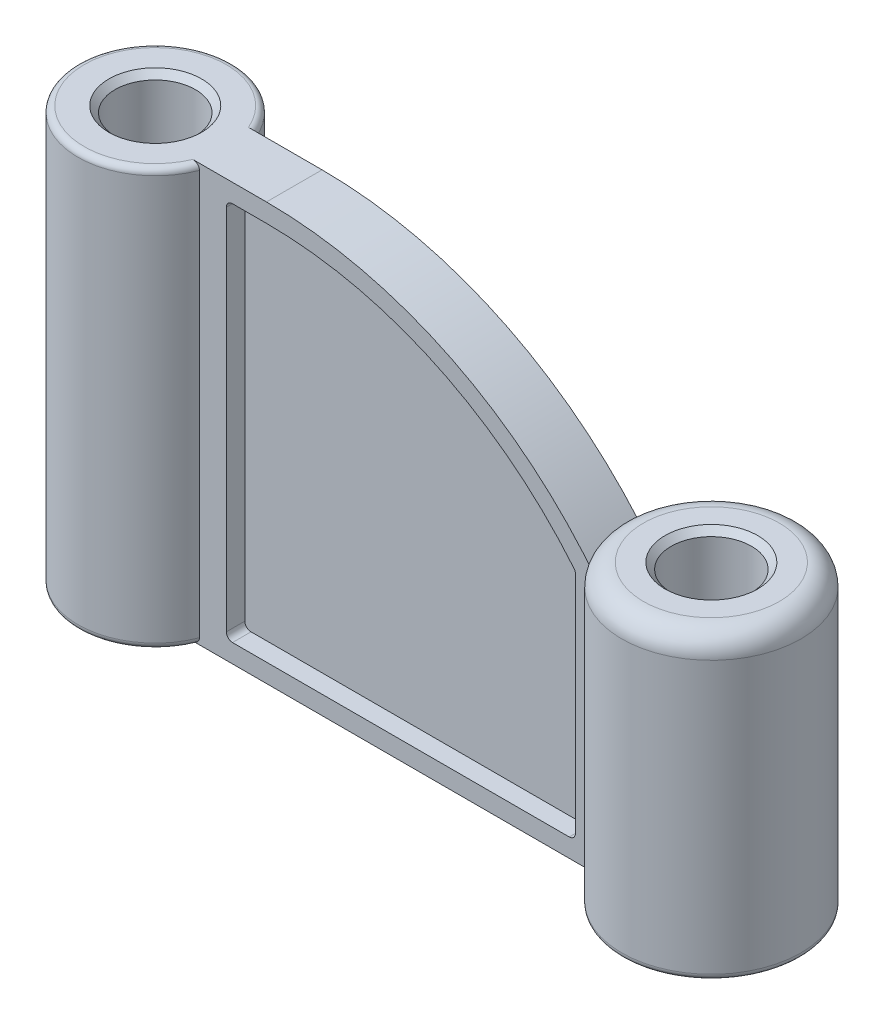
ISO-10303-21;
HEADER;
FILE_DESCRIPTION(('STEP AP214'),'2;1');
FILE_NAME('part.step','',(''),(''),'','','');
FILE_SCHEMA(('AUTOMOTIVE_DESIGN { 1 0 10303 214 1 1 1 1 }'));
ENDSEC;
DATA;
#1=APPLICATION_CONTEXT('core data for automotive mechanical design processes');
#2=APPLICATION_PROTOCOL_DEFINITION('international standard','automotive_design',2000,#1);
#3=PRODUCT_CONTEXT('',#1,'mechanical');
#4=PRODUCT('Part','Part','',(#3));
#5=PRODUCT_RELATED_PRODUCT_CATEGORY('part','',(#4));
#6=PRODUCT_DEFINITION_FORMATION('','',#4);
#7=PRODUCT_DEFINITION_CONTEXT('part definition',#1,'design');
#8=PRODUCT_DEFINITION('design','',#6,#7);
#9=PRODUCT_DEFINITION_SHAPE('','',#8);
#10=(LENGTH_UNIT() NAMED_UNIT(*) SI_UNIT(.MILLI.,.METRE.));
#11=(NAMED_UNIT(*) PLANE_ANGLE_UNIT() SI_UNIT($,.RADIAN.));
#12=(NAMED_UNIT(*) SI_UNIT($,.STERADIAN.) SOLID_ANGLE_UNIT());
#13=UNCERTAINTY_MEASURE_WITH_UNIT(LENGTH_MEASURE(1.E-05),#10,'distance_accuracy_value','');
#14=(GEOMETRIC_REPRESENTATION_CONTEXT(3) GLOBAL_UNCERTAINTY_ASSIGNED_CONTEXT((#13)) GLOBAL_UNIT_ASSIGNED_CONTEXT((#10,
#11,#12)) REPRESENTATION_CONTEXT('',''));
#15=CARTESIAN_POINT('',(0.,0.,0.));
#16=DIRECTION('',(0.,0.,1.));
#17=DIRECTION('',(1.,0.,0.));
#18=AXIS2_PLACEMENT_3D('',#15,#16,#17);
#19=CARTESIAN_POINT('',(23.3238075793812,135.,9.));
#20=DIRECTION('',(0.,0.,-1.));
#21=DIRECTION('',(-1.,0.,0.));
#22=AXIS2_PLACEMENT_3D('',#19,#20,#21);
#23=PLANE('',#22);
#24=DIRECTION('',(0.,-1.,0.));
#25=VECTOR('',#24,1.);
#26=CARTESIAN_POINT('',(152.43190249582,135.,9.));
#27=LINE('',#26,#25);
#28=CARTESIAN_POINT('',(152.43190249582,81.7519805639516,9.));
#29=VERTEX_POINT('',#28);
#30=CARTESIAN_POINT('',(152.43190249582,2.,9.));
#31=VERTEX_POINT('',#30);
#32=EDGE_CURVE('E657',#29,#31,#27,.T.);
#33=ORIENTED_EDGE('',*,*,#32,.F.);
#34=CARTESIAN_POINT('',(45.,0.,9.));
#35=DIRECTION('',(0.,0.,-1.));
#36=DIRECTION('',(-1.,0.,0.));
#37=AXIS2_PLACEMENT_3D('',#34,#35,#36);
#38=CIRCLE('',#37,135.);
#39=CARTESIAN_POINT('',(45.,135.,9.));
#40=VERTEX_POINT('',#39);
#41=EDGE_CURVE('E292',#40,#29,#38,.T.);
#42=ORIENTED_EDGE('',*,*,#41,.F.);
#43=DIRECTION('',(1.,0.,0.));
#44=VECTOR('',#43,1.);
#45=CARTESIAN_POINT('',(23.3238075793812,135.,9.));
#46=LINE('',#45,#44);
#47=CARTESIAN_POINT('',(21.1660104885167,135.,9.));
#48=VERTEX_POINT('',#47);
#49=EDGE_CURVE('E57',#48,#40,#46,.T.);
#50=ORIENTED_EDGE('',*,*,#49,.F.);
#51=CARTESIAN_POINT('',(21.1660104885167,135.,9.));
#52=CARTESIAN_POINT('',(21.2306340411,134.999996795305,9.));
#53=CARTESIAN_POINT('',(21.2952292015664,134.997345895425,9.));
#54=CARTESIAN_POINT('',(21.4239925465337,134.986729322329,9.));
#55=CARTESIAN_POINT('',(21.4881606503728,134.978762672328,9.));
#56=CARTESIAN_POINT('',(21.6795869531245,134.946835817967,9.));
#57=CARTESIAN_POINT('',(21.8056093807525,134.914848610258,9.));
#58=CARTESIAN_POINT('',(22.0505268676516,134.829776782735,9.));
#59=CARTESIAN_POINT('',(22.169409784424,134.776657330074,9.));
#60=CARTESIAN_POINT('',(22.3958383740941,134.650240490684,9.));
#61=CARTESIAN_POINT('',(22.5033963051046,134.576965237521,9.));
#62=CARTESIAN_POINT('',(22.6982714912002,134.415936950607,9.));
#63=CARTESIAN_POINT('',(22.7863259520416,134.329077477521,9.));
#64=CARTESIAN_POINT('',(22.9452006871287,134.140723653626,9.));
#65=CARTESIAN_POINT('',(23.0160214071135,134.039229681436,9.));
#66=CARTESIAN_POINT('',(23.1327899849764,133.83269388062,9.));
#67=CARTESIAN_POINT('',(23.1801917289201,133.728471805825,9.));
#68=CARTESIAN_POINT('',(23.2555272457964,133.513295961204,9.));
#69=CARTESIAN_POINT('',(23.2834938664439,133.402353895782,9.));
#70=CARTESIAN_POINT('',(23.3087009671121,133.241953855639,9.));
#71=CARTESIAN_POINT('',(23.3143651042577,133.193699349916,9.));
#72=CARTESIAN_POINT('',(23.3219146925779,133.096971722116,9.));
#73=CARTESIAN_POINT('',(23.32380605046,133.048499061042,9.));
#74=CARTESIAN_POINT('',(23.3238075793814,133.,9.));
#75=B_SPLINE_CURVE_WITH_KNOTS('',3,(#51,#52,#53,#54,#55,#56,#57,#58,#59,#60,#61,#62,#63,#64,#65,
#66,#67,#68,#69,#70,#71,#72,#73,#74),.UNSPECIFIED.,.F.,.F.,(4,2,2,2,2,2,2,2,2,2,2,4),(0.,
0.193758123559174,0.387551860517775,0.775606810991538,1.16430407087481,1.55257618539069,
1.92167587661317,2.29076602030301,2.6325150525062,2.97368507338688,3.11932126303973,
3.26472926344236),.UNSPECIFIED.);
#76=CARTESIAN_POINT('',(23.3238075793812,133.,8.99999999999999));
#77=VERTEX_POINT('',#76);
#78=EDGE_CURVE('E50',#48,#77,#75,.T.);
#79=ORIENTED_EDGE('',*,*,#78,.T.);
#80=DIRECTION('',(0.,-1.,0.));
#81=VECTOR('',#80,1.);
#82=CARTESIAN_POINT('',(23.3238075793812,135.,8.99999999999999));
#83=LINE('',#82,#81);
#84=CARTESIAN_POINT('',(23.3238075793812,2.,8.99999999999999));
#85=VERTEX_POINT('',#84);
#86=EDGE_CURVE('E651',#77,#85,#83,.T.);
#87=ORIENTED_EDGE('',*,*,#86,.T.);
#88=CARTESIAN_POINT('',(23.3238075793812,2.,8.99999999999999));
#89=CARTESIAN_POINT('',(23.3238150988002,1.9465337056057,9.));
#90=CARTESIAN_POINT('',(23.3215096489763,1.89307103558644,9.));
#91=CARTESIAN_POINT('',(23.3123305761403,1.78654835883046,9.));
#92=CARTESIAN_POINT('',(23.305457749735,1.73348828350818,9.));
#93=CARTESIAN_POINT('',(23.2872242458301,1.62827766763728,9.));
#94=CARTESIAN_POINT('',(23.2758747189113,1.57612520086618,9.));
#95=CARTESIAN_POINT('',(23.2488099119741,1.4729801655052,9.));
#96=CARTESIAN_POINT('',(23.2330945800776,1.42198761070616,9.));
#97=CARTESIAN_POINT('',(23.1796063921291,1.27129759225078,9.));
#98=CARTESIAN_POINT('',(23.1354720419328,1.17377789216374,9.));
#99=CARTESIAN_POINT('',(23.0318807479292,0.987311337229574,9.));
#100=CARTESIAN_POINT('',(22.9724189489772,0.898367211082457,9.));
#101=CARTESIAN_POINT('',(22.8384005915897,0.728846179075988,9.));
#102=CARTESIAN_POINT('',(22.7634885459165,0.648550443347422,9.));
#103=CARTESIAN_POINT('',(22.6019736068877,0.50076690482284,9.));
#104=CARTESIAN_POINT('',(22.5153682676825,0.433281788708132,9.));
#105=CARTESIAN_POINT('',(22.3270975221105,0.308424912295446,9.));
#106=CARTESIAN_POINT('',(22.2248243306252,0.251970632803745,9.));
#107=CARTESIAN_POINT('',(22.0126831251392,0.155727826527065,9.));
#108=CARTESIAN_POINT('',(21.9028112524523,0.115947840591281,9.));
#109=CARTESIAN_POINT('',(21.6889620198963,0.0565012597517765,9.));
#110=CARTESIAN_POINT('',(21.5854087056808,0.0352892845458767,9.));
#111=CARTESIAN_POINT('',(21.3765677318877,0.00703920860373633,9.));
#112=CARTESIAN_POINT('',(21.271283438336,-2.37241459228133E-05,9.));
#113=CARTESIAN_POINT('',(21.1660104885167,0.,9.));
#114=B_SPLINE_CURVE_WITH_KNOTS('',3,(#88,#89,#90,#91,#92,#93,#94,#95,#96,#97,#98,#99,#100,#101,
#102,#103,#104,#105,#106,#107,#108,#109,#110,#111,#112,#113),.UNSPECIFIED.,.F.,.F.,(4,2,2,2,2,2,
2,2,2,2,2,2,4),(0.,0.160342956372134,0.320657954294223,0.480576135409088,0.640496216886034,
0.960005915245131,1.27961694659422,1.60762371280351,1.93569919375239,2.28466302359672,
2.63380538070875,2.94995627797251,3.26555183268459),.UNSPECIFIED.);
#115=CARTESIAN_POINT('',(21.1660104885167,0.,9.));
#116=VERTEX_POINT('',#115);
#117=EDGE_CURVE('E338',#85,#116,#114,.T.);
#118=ORIENTED_EDGE('',*,*,#117,.T.);
#119=DIRECTION('',(1.,0.,0.));
#120=VECTOR('',#119,1.);
#121=CARTESIAN_POINT('',(23.3238075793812,0.,9.));
#122=LINE('',#121,#120);
#123=CARTESIAN_POINT('',(154.544155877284,0.,9.));
#124=VERTEX_POINT('',#123);
#125=EDGE_CURVE('E751',#116,#124,#122,.T.);
#126=ORIENTED_EDGE('',*,*,#125,.T.);
#127=CARTESIAN_POINT('',(154.544155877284,0.,9.));
#128=CARTESIAN_POINT('',(154.482072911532,2.31363572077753E-06,9.));
#129=CARTESIAN_POINT('',(154.42001803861,0.00257104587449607,9.));
#130=CARTESIAN_POINT('',(154.296328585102,0.0128441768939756,9.));
#131=CARTESIAN_POINT('',(154.234694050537,0.0205491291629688,9.));
#132=CARTESIAN_POINT('',(154.050954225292,0.0513772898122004,9.));
#133=CARTESIAN_POINT('',(153.930046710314,0.0822138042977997,9.));
#134=CARTESIAN_POINT('',(153.695095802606,0.163977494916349,9.));
#135=CARTESIAN_POINT('',(153.5810612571,0.214929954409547,9.));
#136=CARTESIAN_POINT('',(153.363625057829,0.335867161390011,9.));
#137=CARTESIAN_POINT('',(153.26021518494,0.405837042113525,9.));
#138=CARTESIAN_POINT('',(153.070722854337,0.560544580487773,9.));
#139=CARTESIAN_POINT('',(152.984182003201,0.644720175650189,9.));
#140=CARTESIAN_POINT('',(152.827402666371,0.827159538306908,9.));
#141=CARTESIAN_POINT('',(152.75716509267,0.925424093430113,9.));
#142=CARTESIAN_POINT('',(152.638980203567,1.12759593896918,9.));
#143=CARTESIAN_POINT('',(152.590050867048,1.23093036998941,9.));
#144=CARTESIAN_POINT('',(152.511186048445,1.44454365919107,9.));
#145=CARTESIAN_POINT('',(152.481224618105,1.55481280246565,9.));
#146=CARTESIAN_POINT('',(152.451529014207,1.72177406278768,9.));
#147=CARTESIAN_POINT('',(152.444171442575,1.77720549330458,9.));
#148=CARTESIAN_POINT('',(152.434361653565,1.88841496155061,9.));
#149=CARTESIAN_POINT('',(152.431901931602,1.9441923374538,9.));
#150=CARTESIAN_POINT('',(152.43190249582,2.,9.));
#151=B_SPLINE_CURVE_WITH_KNOTS('',3,(#127,#128,#129,#130,#131,#132,#133,#134,#135,#136,#137,
#138,#139,#140,#141,#142,#143,#144,#145,#146,#147,#148,#149,#150),.UNSPECIFIED.,.F.,.F.,(4,2,2,
2,2,2,2,2,2,2,2,4),(0.,0.186138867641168,0.372297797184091,0.744716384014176,1.11760455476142,
1.49020205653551,1.85053212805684,2.21088235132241,2.55218411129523,2.89301795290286,
3.06058398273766,3.22789306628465),.UNSPECIFIED.);
#152=EDGE_CURVE('E331',#124,#31,#151,.T.);
#153=ORIENTED_EDGE('',*,*,#152,.T.);
#154=EDGE_LOOP('',(#33,#42,#50,#79,#87,#118,#126,#153));
#155=FACE_BOUND('',#154,.T.);
#156=CARTESIAN_POINT('',(45.,0.,9.));
#157=DIRECTION('',(0.,0.,1.));
#158=DIRECTION('',(1.,0.,0.));
#159=AXIS2_PLACEMENT_3D('',#156,#157,#158);
#160=CIRCLE('',#159,129.);
#161=CARTESIAN_POINT('',(144.543307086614,82.0495582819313,9.));
#162=VERTEX_POINT('',#161);
#163=CARTESIAN_POINT('',(45.,129.,9.));
#164=VERTEX_POINT('',#163);
#165=EDGE_CURVE('E261',#162,#164,#160,.T.);
#166=ORIENTED_EDGE('',*,*,#165,.F.);
#167=CARTESIAN_POINT('',(143.,80.7774721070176,9.));
#168=DIRECTION('',(0.,0.,-1.));
#169=DIRECTION('',(-1.,0.,0.));
#170=AXIS2_PLACEMENT_3D('',#167,#168,#169);
#171=CIRCLE('',#170,2.);
#172=CARTESIAN_POINT('',(145.,80.7774721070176,9.));
#173=VERTEX_POINT('',#172);
#174=EDGE_CURVE('E484',#162,#173,#171,.T.);
#175=ORIENTED_EDGE('',*,*,#174,.T.);
#176=DIRECTION('',(0.,-1.,0.));
#177=VECTOR('',#176,1.);
#178=CARTESIAN_POINT('',(145.,81.4923309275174,9.));
#179=LINE('',#178,#177);
#180=CARTESIAN_POINT('',(145.,8.00000000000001,9.));
#181=VERTEX_POINT('',#180);
#182=EDGE_CURVE('E245',#173,#181,#179,.T.);
#183=ORIENTED_EDGE('',*,*,#182,.T.);
#184=CARTESIAN_POINT('',(143.,8.00000000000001,9.));
#185=DIRECTION('',(0.,0.,-1.));
#186=DIRECTION('',(-1.,0.,0.));
#187=AXIS2_PLACEMENT_3D('',#184,#185,#186);
#188=CIRCLE('',#187,2.);
#189=CARTESIAN_POINT('',(143.,6.,9.));
#190=VERTEX_POINT('',#189);
#191=EDGE_CURVE('E485',#181,#190,#188,.T.);
#192=ORIENTED_EDGE('',*,*,#191,.T.);
#193=DIRECTION('',(1.,0.,0.));
#194=VECTOR('',#193,1.);
#195=CARTESIAN_POINT('',(32.,6.,9.));
#196=LINE('',#195,#194);
#197=CARTESIAN_POINT('',(34.,6.,9.));
#198=VERTEX_POINT('',#197);
#199=EDGE_CURVE('E249',#198,#190,#196,.T.);
#200=ORIENTED_EDGE('',*,*,#199,.F.);
#201=CARTESIAN_POINT('',(34.,8.,9.));
#202=DIRECTION('',(0.,0.,-1.));
#203=DIRECTION('',(-1.,0.,0.));
#204=AXIS2_PLACEMENT_3D('',#201,#202,#203);
#205=CIRCLE('',#204,2.);
#206=CARTESIAN_POINT('',(32.,8.00000000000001,9.));
#207=VERTEX_POINT('',#206);
#208=EDGE_CURVE('E367',#198,#207,#205,.T.);
#209=ORIENTED_EDGE('',*,*,#208,.T.);
#210=DIRECTION('',(0.,-1.,0.));
#211=VECTOR('',#210,1.);
#212=CARTESIAN_POINT('',(32.,129.,9.));
#213=LINE('',#212,#211);
#214=CARTESIAN_POINT('',(32.,127.,9.));
#215=VERTEX_POINT('',#214);
#216=EDGE_CURVE('E275',#215,#207,#213,.T.);
#217=ORIENTED_EDGE('',*,*,#216,.F.);
#218=CARTESIAN_POINT('',(34.,127.,9.));
#219=DIRECTION('',(0.,0.,-1.));
#220=DIRECTION('',(-1.,0.,0.));
#221=AXIS2_PLACEMENT_3D('',#218,#219,#220);
#222=CIRCLE('',#221,2.);
#223=CARTESIAN_POINT('',(34.,129.,9.));
#224=VERTEX_POINT('',#223);
#225=EDGE_CURVE('E482',#215,#224,#222,.T.);
#226=ORIENTED_EDGE('',*,*,#225,.T.);
#227=DIRECTION('',(1.,0.,0.));
#228=VECTOR('',#227,1.);
#229=CARTESIAN_POINT('',(32.,129.,9.));
#230=LINE('',#229,#228);
#231=EDGE_CURVE('E278',#224,#164,#230,.T.);
#232=ORIENTED_EDGE('',*,*,#231,.T.);
#233=EDGE_LOOP('',(#166,#175,#183,#192,#200,#209,#217,#226,#232));
#234=FACE_BOUND('',#233,.T.);
#235=ADVANCED_FACE('F37',(#155,#234),#23,.F.);
#236=CARTESIAN_POINT('',(180.,135.,0.));
#237=DIRECTION('',(0.,1.,0.));
#238=DIRECTION('',(0.,0.,1.));
#239=AXIS2_PLACEMENT_3D('',#236,#237,#238);
#240=PLANE('',#239);
#241=CARTESIAN_POINT('',(0.,135.,0.));
#242=DIRECTION('',(0.,1.,0.));
#243=DIRECTION('',(0.,0.,1.));
#244=AXIS2_PLACEMENT_3D('',#241,#242,#243);
#245=CIRCLE('',#244,15.);
#246=CARTESIAN_POINT('',(0.,135.,15.));
#247=VERTEX_POINT('',#246);
#248=EDGE_CURVE('E681',#247,#247,#245,.F.);
#249=ORIENTED_EDGE('',*,*,#248,.T.);
#250=EDGE_LOOP('',(#249));
#251=FACE_BOUND('',#250,.T.);
#252=CARTESIAN_POINT('',(0.,135.,0.));
#253=DIRECTION('',(0.,1.,0.));
#254=DIRECTION('',(0.,0.,1.));
#255=AXIS2_PLACEMENT_3D('',#252,#253,#254);
#256=CIRCLE('',#255,23.);
#257=CARTESIAN_POINT('',(21.1660104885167,135.,-9.));
#258=VERTEX_POINT('',#257);
#259=EDGE_CURVE('E472',#258,#48,#256,.T.);
#260=ORIENTED_EDGE('',*,*,#259,.T.);
#261=ORIENTED_EDGE('',*,*,#49,.T.);
#262=DIRECTION('',(0.,0.,1.));
#263=VECTOR('',#262,1.);
#264=CARTESIAN_POINT('',(45.,135.,-29.));
#265=LINE('',#264,#263);
#266=CARTESIAN_POINT('',(45.,135.,-9.));
#267=VERTEX_POINT('',#266);
#268=EDGE_CURVE('E749',#267,#40,#265,.T.);
#269=ORIENTED_EDGE('',*,*,#268,.F.);
#270=DIRECTION('',(-1.,0.,0.));
#271=VECTOR('',#270,1.);
#272=CARTESIAN_POINT('',(23.3238075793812,135.,-9.));
#273=LINE('',#272,#271);
#274=EDGE_CURVE('E65',#267,#258,#273,.T.);
#275=ORIENTED_EDGE('',*,*,#274,.T.);
#276=EDGE_LOOP('',(#260,#261,#269,#275));
#277=FACE_BOUND('',#276,.T.);
#278=ADVANCED_FACE('F316',(#251,#277),#240,.T.);
#279=CARTESIAN_POINT('',(180.,0.,0.));
#280=DIRECTION('',(0.,1.,0.));
#281=DIRECTION('',(0.,0.,1.));
#282=AXIS2_PLACEMENT_3D('',#279,#280,#281);
#283=PLANE('',#282);
#284=CARTESIAN_POINT('',(180.,0.,0.));
#285=DIRECTION('',(0.,1.,0.));
#286=DIRECTION('',(0.,0.,1.));
#287=AXIS2_PLACEMENT_3D('',#284,#285,#286);
#288=CIRCLE('',#287,15.);
#289=CARTESIAN_POINT('',(180.,0.,15.));
#290=VERTEX_POINT('',#289);
#291=EDGE_CURVE('E663',#290,#290,#288,.T.);
#292=ORIENTED_EDGE('',*,*,#291,.T.);
#293=EDGE_LOOP('',(#292));
#294=FACE_BOUND('',#293,.T.);
#295=CARTESIAN_POINT('',(0.,0.,0.));
#296=DIRECTION('',(0.,1.,0.));
#297=DIRECTION('',(0.,0.,1.));
#298=AXIS2_PLACEMENT_3D('',#295,#296,#297);
#299=CIRCLE('',#298,15.);
#300=CARTESIAN_POINT('',(0.,0.,15.));
#301=VERTEX_POINT('',#300);
#302=EDGE_CURVE('E654',#301,#301,#299,.T.);
#303=ORIENTED_EDGE('',*,*,#302,.T.);
#304=EDGE_LOOP('',(#303));
#305=FACE_BOUND('',#304,.T.);
#306=DIRECTION('',(-1.,0.,0.));
#307=VECTOR('',#306,1.);
#308=CARTESIAN_POINT('',(23.3238075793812,0.,-9.));
#309=LINE('',#308,#307);
#310=CARTESIAN_POINT('',(154.544155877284,0.,-9.));
#311=VERTEX_POINT('',#310);
#312=CARTESIAN_POINT('',(21.1660104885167,0.,-9.));
#313=VERTEX_POINT('',#312);
#314=EDGE_CURVE('E747',#311,#313,#309,.T.);
#315=ORIENTED_EDGE('',*,*,#314,.F.);
#316=CARTESIAN_POINT('',(180.,0.,0.));
#317=DIRECTION('',(0.,1.,0.));
#318=DIRECTION('',(0.,0.,1.));
#319=AXIS2_PLACEMENT_3D('',#316,#317,#318);
#320=CIRCLE('',#319,27.);
#321=EDGE_CURVE('E464',#311,#124,#320,.F.);
#322=ORIENTED_EDGE('',*,*,#321,.T.);
#323=ORIENTED_EDGE('',*,*,#125,.F.);
#324=CARTESIAN_POINT('',(0.,0.,0.));
#325=DIRECTION('',(0.,1.,0.));
#326=DIRECTION('',(0.,0.,1.));
#327=AXIS2_PLACEMENT_3D('',#324,#325,#326);
#328=CIRCLE('',#327,23.);
#329=EDGE_CURVE('E461',#116,#313,#328,.F.);
#330=ORIENTED_EDGE('',*,*,#329,.T.);
#331=EDGE_LOOP('',(#315,#322,#323,#330));
#332=FACE_BOUND('',#331,.T.);
#333=ADVANCED_FACE('F319',(#294,#305,#332),#283,.F.);
#334=CARTESIAN_POINT('',(180.,135.,0.));
#335=DIRECTION('',(0.,-1.,0.));
#336=DIRECTION('',(0.,0.,-1.));
#337=AXIS2_PLACEMENT_3D('',#334,#335,#336);
#338=CYLINDRICAL_SURFACE('',#337,29.);
#339=CARTESIAN_POINT('',(180.,90.,0.));
#340=DIRECTION('',(0.,-1.,0.));
#341=DIRECTION('',(1.,0.,0.));
#342=AXIS2_PLACEMENT_3D('',#339,#340,#341);
#343=CIRCLE('',#342,29.);
#344=CARTESIAN_POINT('',(209.,90.,0.));
#345=VERTEX_POINT('',#344);
#346=EDGE_CURVE('E684',#345,#345,#343,.T.);
#347=ORIENTED_EDGE('',*,*,#346,.T.);
#348=EDGE_LOOP('',(#347));
#349=FACE_BOUND('',#348,.T.);
#350=ORIENTED_EDGE('',*,*,#32,.T.);
#351=CARTESIAN_POINT('',(180.,2.,0.));
#352=DIRECTION('',(0.,1.,0.));
#353=DIRECTION('',(0.,0.,1.));
#354=AXIS2_PLACEMENT_3D('',#351,#352,#353);
#355=CIRCLE('',#354,29.);
#356=CARTESIAN_POINT('',(152.43190249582,2.,-9.));
#357=VERTEX_POINT('',#356);
#358=EDGE_CURVE('E458',#31,#357,#355,.T.);
#359=ORIENTED_EDGE('',*,*,#358,.T.);
#360=DIRECTION('',(0.,-1.,0.));
#361=VECTOR('',#360,1.);
#362=CARTESIAN_POINT('',(152.43190249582,135.,-9.));
#363=LINE('',#362,#361);
#364=CARTESIAN_POINT('',(152.43190249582,81.7519805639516,-9.));
#365=VERTEX_POINT('',#364);
#366=EDGE_CURVE('E650',#365,#357,#363,.T.);
#367=ORIENTED_EDGE('',*,*,#366,.F.);
#368=CARTESIAN_POINT('',(152.43190249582,81.7519805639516,-9.00000000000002));
#369=CARTESIAN_POINT('',(152.355383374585,81.8525355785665,-8.7656145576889));
#370=CARTESIAN_POINT('',(152.281402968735,81.949462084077,-8.52886716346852));
#371=CARTESIAN_POINT('',(152.138799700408,82.1358105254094,-8.05082308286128));
#372=CARTESIAN_POINT('',(152.070177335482,82.2252317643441,-7.80952597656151));
#373=CARTESIAN_POINT('',(151.872737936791,82.4819044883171,-7.07895206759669));
#374=CARTESIAN_POINT('',(151.752407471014,82.6374878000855,-6.58317195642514));
#375=CARTESIAN_POINT('',(151.536868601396,82.91517666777,-5.57798721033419));
#376=CARTESIAN_POINT('',(151.441616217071,83.0373408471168,-5.06860817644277));
#377=CARTESIAN_POINT('',(151.277854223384,83.246834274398,-4.03858312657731));
#378=CARTESIAN_POINT('',(151.209338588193,83.334171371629,-3.51793967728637));
#379=CARTESIAN_POINT('',(151.100227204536,83.4730475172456,-2.4665240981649));
#380=CARTESIAN_POINT('',(151.059761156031,83.5244202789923,-1.9357164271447));
#381=CARTESIAN_POINT('',(151.008156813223,83.5899063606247,-0.870325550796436));
#382=CARTESIAN_POINT('',(150.997021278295,83.6040161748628,-0.335741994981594));
#383=CARTESIAN_POINT('',(151.004338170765,83.5947385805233,0.732849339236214));
#384=CARTESIAN_POINT('',(151.022788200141,83.5713542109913,1.26685716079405));
#385=CARTESIAN_POINT('',(151.088852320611,83.487473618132,2.33006330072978));
#386=CARTESIAN_POINT('',(151.136463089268,83.4269816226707,2.85926216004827));
#387=CARTESIAN_POINT('',(151.25572084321,83.2750287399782,3.8742903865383));
#388=CARTESIAN_POINT('',(151.325576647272,83.1858719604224,4.36067921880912));
#389=CARTESIAN_POINT('',(151.488524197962,82.9771759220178,5.32296358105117));
#390=CARTESIAN_POINT('',(151.581618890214,82.8576328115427,5.79885777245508));
#391=CARTESIAN_POINT('',(151.789547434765,82.5894746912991,6.73809547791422));
#392=CARTESIAN_POINT('',(151.904403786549,82.4408295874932,7.20142542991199));
#393=CARTESIAN_POINT('',(152.091489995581,82.1974647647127,7.88485255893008));
#394=CARTESIAN_POINT('',(152.156309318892,82.1129563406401,8.11070409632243));
#395=CARTESIAN_POINT('',(152.290643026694,81.9373549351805,8.55839594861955));
#396=CARTESIAN_POINT('',(152.360157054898,81.8462624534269,8.7802365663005));
#397=CARTESIAN_POINT('',(152.43190249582,81.7519805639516,9.00000000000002));
#398=B_SPLINE_CURVE_WITH_KNOTS('',3,(#368,#369,#370,#371,#372,#373,#374,#375,#376,#377,#378,
#379,#380,#381,#382,#383,#384,#385,#386,#387,#388,#389,#390,#391,#392,#393,#394,#395,#396,#397),
.UNSPECIFIED.,.F.,.F.,(4,2,2,2,2,2,2,2,2,2,2,2,2,2,4),(0.,0.798734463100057,1.59754300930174,
3.19577003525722,4.79117522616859,6.3862206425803,7.98859313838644,9.59111637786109,
11.1935097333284,12.7957205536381,14.2923229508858,15.7891151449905,17.2874634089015,
18.0364365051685,18.7853528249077),.UNSPECIFIED.);
#399=EDGE_CURVE('E284',#365,#29,#398,.T.);
#400=ORIENTED_EDGE('',*,*,#399,.T.);
#401=EDGE_LOOP('',(#350,#359,#367,#400));
#402=FACE_BOUND('',#401,.T.);
#403=ADVANCED_FACE('F323',(#349,#402),#338,.T.);
#404=CARTESIAN_POINT('',(23.3238075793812,135.,-9.));
#405=DIRECTION('',(0.,0.,1.));
#406=DIRECTION('',(1.,0.,0.));
#407=AXIS2_PLACEMENT_3D('',#404,#405,#406);
#408=PLANE('',#407);
#409=DIRECTION('',(0.,-1.,0.));
#410=VECTOR('',#409,1.);
#411=CARTESIAN_POINT('',(32.,129.,-9.));
#412=LINE('',#411,#410);
#413=CARTESIAN_POINT('',(32.,127.,-9.));
#414=VERTEX_POINT('',#413);
#415=CARTESIAN_POINT('',(32.,8.00000000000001,-9.));
#416=VERTEX_POINT('',#415);
#417=EDGE_CURVE('E725',#414,#416,#412,.T.);
#418=ORIENTED_EDGE('',*,*,#417,.T.);
#419=CARTESIAN_POINT('',(34.,8.00000000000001,-9.));
#420=DIRECTION('',(0.,0.,1.));
#421=DIRECTION('',(1.,0.,0.));
#422=AXIS2_PLACEMENT_3D('',#419,#420,#421);
#423=CIRCLE('',#422,2.);
#424=CARTESIAN_POINT('',(34.,6.,-9.));
#425=VERTEX_POINT('',#424);
#426=EDGE_CURVE('E474',#416,#425,#423,.T.);
#427=ORIENTED_EDGE('',*,*,#426,.T.);
#428=DIRECTION('',(1.,0.,0.));
#429=VECTOR('',#428,1.);
#430=CARTESIAN_POINT('',(32.,6.,-9.));
#431=LINE('',#430,#429);
#432=CARTESIAN_POINT('',(143.,6.,-9.));
#433=VERTEX_POINT('',#432);
#434=EDGE_CURVE('E255',#425,#433,#431,.T.);
#435=ORIENTED_EDGE('',*,*,#434,.T.);
#436=CARTESIAN_POINT('',(143.,8.,-9.));
#437=DIRECTION('',(0.,0.,1.));
#438=DIRECTION('',(1.,0.,0.));
#439=AXIS2_PLACEMENT_3D('',#436,#437,#438);
#440=CIRCLE('',#439,2.);
#441=CARTESIAN_POINT('',(145.,8.00000000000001,-9.));
#442=VERTEX_POINT('',#441);
#443=EDGE_CURVE('E476',#433,#442,#440,.T.);
#444=ORIENTED_EDGE('',*,*,#443,.T.);
#445=DIRECTION('',(0.,-1.,0.));
#446=VECTOR('',#445,1.);
#447=CARTESIAN_POINT('',(145.,81.4923309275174,-9.));
#448=LINE('',#447,#446);
#449=CARTESIAN_POINT('',(145.,80.7774721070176,-9.));
#450=VERTEX_POINT('',#449);
#451=EDGE_CURVE('E717',#450,#442,#448,.T.);
#452=ORIENTED_EDGE('',*,*,#451,.F.);
#453=CARTESIAN_POINT('',(143.,80.7774721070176,-9.));
#454=DIRECTION('',(0.,0.,1.));
#455=DIRECTION('',(1.,0.,0.));
#456=AXIS2_PLACEMENT_3D('',#453,#454,#455);
#457=CIRCLE('',#456,2.);
#458=CARTESIAN_POINT('',(144.543307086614,82.0495582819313,-9.));
#459=VERTEX_POINT('',#458);
#460=EDGE_CURVE('E478',#450,#459,#457,.T.);
#461=ORIENTED_EDGE('',*,*,#460,.T.);
#462=CARTESIAN_POINT('',(45.,0.,-9.));
#463=DIRECTION('',(0.,0.,1.));
#464=DIRECTION('',(1.,0.,0.));
#465=AXIS2_PLACEMENT_3D('',#462,#463,#464);
#466=CIRCLE('',#465,129.);
#467=CARTESIAN_POINT('',(45.,129.,-9.));
#468=VERTEX_POINT('',#467);
#469=EDGE_CURVE('E727',#459,#468,#466,.T.);
#470=ORIENTED_EDGE('',*,*,#469,.T.);
#471=DIRECTION('',(1.,0.,0.));
#472=VECTOR('',#471,1.);
#473=CARTESIAN_POINT('',(32.,129.,-9.));
#474=LINE('',#473,#472);
#475=CARTESIAN_POINT('',(34.,129.,-9.));
#476=VERTEX_POINT('',#475);
#477=EDGE_CURVE('E243',#476,#468,#474,.T.);
#478=ORIENTED_EDGE('',*,*,#477,.F.);
#479=CARTESIAN_POINT('',(34.,127.,-9.));
#480=DIRECTION('',(0.,0.,1.));
#481=DIRECTION('',(1.,0.,0.));
#482=AXIS2_PLACEMENT_3D('',#479,#480,#481);
#483=CIRCLE('',#482,2.);
#484=EDGE_CURVE('E480',#476,#414,#483,.T.);
#485=ORIENTED_EDGE('',*,*,#484,.T.);
#486=EDGE_LOOP('',(#418,#427,#435,#444,#452,#461,#470,#478,#485));
#487=FACE_BOUND('',#486,.T.);
#488=ORIENTED_EDGE('',*,*,#274,.F.);
#489=CARTESIAN_POINT('',(45.,0.,-9.));
#490=DIRECTION('',(0.,0.,1.));
#491=DIRECTION('',(1.,0.,0.));
#492=AXIS2_PLACEMENT_3D('',#489,#490,#491);
#493=CIRCLE('',#492,135.);
#494=EDGE_CURVE('E748',#267,#365,#493,.F.);
#495=ORIENTED_EDGE('',*,*,#494,.T.);
#496=ORIENTED_EDGE('',*,*,#366,.T.);
#497=CARTESIAN_POINT('',(152.43190249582,2.,-9.));
#498=CARTESIAN_POINT('',(152.431901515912,1.94578105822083,-9.));
#499=CARTESIAN_POINT('',(152.43422335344,1.89158878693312,-9.));
#500=CARTESIAN_POINT('',(152.443476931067,1.78360691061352,-9.));
#501=CARTESIAN_POINT('',(152.450408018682,1.72981724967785,-9.));
#502=CARTESIAN_POINT('',(152.478008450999,1.56986655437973,-9.));
#503=CARTESIAN_POINT('',(152.505485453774,1.46480156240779,-9.));
#504=CARTESIAN_POINT('',(152.577623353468,1.26082097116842,-9.));
#505=CARTESIAN_POINT('',(152.622284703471,1.16190553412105,-9.));
#506=CARTESIAN_POINT('',(152.727269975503,0.972753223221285,-9.));
#507=CARTESIAN_POINT('',(152.78759690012,0.882518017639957,-9.));
#508=CARTESIAN_POINT('',(152.923313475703,0.711260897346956,-9.));
#509=CARTESIAN_POINT('',(152.998978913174,0.630457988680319,-9.));
#510=CARTESIAN_POINT('',(153.162261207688,0.482004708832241,-9.));
#511=CARTESIAN_POINT('',(153.249880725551,0.414357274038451,-9.));
#512=CARTESIAN_POINT('',(153.438939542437,0.290731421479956,-9.));
#513=CARTESIAN_POINT('',(153.540834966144,0.235451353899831,-9.));
#514=CARTESIAN_POINT('',(153.752148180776,0.141837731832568,-9.));
#515=CARTESIAN_POINT('',(153.861567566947,0.103507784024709,-9.));
#516=CARTESIAN_POINT('',(154.066372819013,0.0493496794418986,-9.));
#517=CARTESIAN_POINT('',(154.161061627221,0.0308374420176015,-9.));
#518=CARTESIAN_POINT('',(154.351883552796,0.00616239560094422,-9.));
#519=CARTESIAN_POINT('',(154.448014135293,-1.99954020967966E-05,-9.));
#520=CARTESIAN_POINT('',(154.544155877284,0.,-9.));
#521=B_SPLINE_CURVE_WITH_KNOTS('',3,(#497,#498,#499,#500,#501,#502,#503,#504,#505,#506,#507,
#508,#509,#510,#511,#512,#513,#514,#515,#516,#517,#518,#519,#520),.UNSPECIFIED.,.F.,.F.,(4,2,2,
2,2,2,2,2,2,2,2,4),(0.,0.162554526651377,0.32508604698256,0.649194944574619,0.973312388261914,
1.29749200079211,1.62812095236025,1.95882361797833,2.30507798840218,2.65140600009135,
2.94006595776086,3.22826710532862),.UNSPECIFIED.);
#522=EDGE_CURVE('E361',#357,#311,#521,.T.);
#523=ORIENTED_EDGE('',*,*,#522,.T.);
#524=ORIENTED_EDGE('',*,*,#314,.T.);
#525=CARTESIAN_POINT('',(21.1660104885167,0.,-9.));
#526=CARTESIAN_POINT('',(21.2306340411,3.20469514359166E-06,-9.));
#527=CARTESIAN_POINT('',(21.2952292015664,0.00265410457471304,-9.));
#528=CARTESIAN_POINT('',(21.4239925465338,0.0132706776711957,-9.));
#529=CARTESIAN_POINT('',(21.4881606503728,0.0212373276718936,-9.));
#530=CARTESIAN_POINT('',(21.6795869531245,0.0531641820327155,-9.));
#531=CARTESIAN_POINT('',(21.8056093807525,0.0851513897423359,-9.));
#532=CARTESIAN_POINT('',(22.0505268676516,0.170223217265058,-9.));
#533=CARTESIAN_POINT('',(22.169409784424,0.223342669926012,-9.));
#534=CARTESIAN_POINT('',(22.3958383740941,0.349759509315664,-9.));
#535=CARTESIAN_POINT('',(22.5033963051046,0.423034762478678,-9.));
#536=CARTESIAN_POINT('',(22.6982714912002,0.584063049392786,-9.));
#537=CARTESIAN_POINT('',(22.7863259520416,0.670922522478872,-9.));
#538=CARTESIAN_POINT('',(22.9452006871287,0.859276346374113,-9.));
#539=CARTESIAN_POINT('',(23.0160214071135,0.960770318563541,-9.));
#540=CARTESIAN_POINT('',(23.1327899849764,1.16730611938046,-9.));
#541=CARTESIAN_POINT('',(23.1801917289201,1.27152819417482,-9.));
#542=CARTESIAN_POINT('',(23.2555272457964,1.48670403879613,-9.));
#543=CARTESIAN_POINT('',(23.2834938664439,1.59764610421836,-9.));
#544=CARTESIAN_POINT('',(23.3087009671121,1.75804614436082,-9.));
#545=CARTESIAN_POINT('',(23.3143651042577,1.80630065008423,-9.));
#546=CARTESIAN_POINT('',(23.3219146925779,1.90302827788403,-9.));
#547=CARTESIAN_POINT('',(23.32380605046,1.95150093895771,-9.));
#548=CARTESIAN_POINT('',(23.3238075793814,1.99999999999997,-9.));
#549=B_SPLINE_CURVE_WITH_KNOTS('',3,(#525,#526,#527,#528,#529,#530,#531,#532,#533,#534,#535,
#536,#537,#538,#539,#540,#541,#542,#543,#544,#545,#546,#547,#548),.UNSPECIFIED.,.F.,.F.,(4,2,2,
2,2,2,2,2,2,2,2,4),(0.,0.193758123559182,0.387551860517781,0.775606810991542,1.16430407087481,
1.55257618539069,1.92167587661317,2.290766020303,2.63251505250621,2.9736850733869,
3.11932126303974,3.26472926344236),.UNSPECIFIED.);
#550=CARTESIAN_POINT('',(23.3238075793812,2.,-9.));
#551=VERTEX_POINT('',#550);
#552=EDGE_CURVE('E344',#313,#551,#549,.T.);
#553=ORIENTED_EDGE('',*,*,#552,.T.);
#554=DIRECTION('',(0.,-1.,0.));
#555=VECTOR('',#554,1.);
#556=CARTESIAN_POINT('',(23.3238075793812,135.,-9.));
#557=LINE('',#556,#555);
#558=CARTESIAN_POINT('',(23.3238075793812,133.,-9.));
#559=VERTEX_POINT('',#558);
#560=EDGE_CURVE('E646',#559,#551,#557,.T.);
#561=ORIENTED_EDGE('',*,*,#560,.F.);
#562=CARTESIAN_POINT('',(23.3238075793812,133.,-9.));
#563=CARTESIAN_POINT('',(23.3238150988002,133.053466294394,-9.));
#564=CARTESIAN_POINT('',(23.3215096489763,133.106928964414,-9.));
#565=CARTESIAN_POINT('',(23.3123305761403,133.21345164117,-9.));
#566=CARTESIAN_POINT('',(23.305457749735,133.266511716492,-9.));
#567=CARTESIAN_POINT('',(23.2872242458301,133.371722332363,-9.));
#568=CARTESIAN_POINT('',(23.2758747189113,133.423874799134,-9.));
#569=CARTESIAN_POINT('',(23.2488099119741,133.527019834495,-9.));
#570=CARTESIAN_POINT('',(23.2330945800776,133.578012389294,-9.));
#571=CARTESIAN_POINT('',(23.1796063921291,133.728702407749,-9.));
#572=CARTESIAN_POINT('',(23.1354720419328,133.826222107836,-9.));
#573=CARTESIAN_POINT('',(23.0318807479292,134.01268866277,-9.));
#574=CARTESIAN_POINT('',(22.9724189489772,134.101632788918,-9.));
#575=CARTESIAN_POINT('',(22.8384005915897,134.271153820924,-9.));
#576=CARTESIAN_POINT('',(22.7634885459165,134.351449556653,-9.));
#577=CARTESIAN_POINT('',(22.6019736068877,134.499233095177,-9.));
#578=CARTESIAN_POINT('',(22.5153682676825,134.566718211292,-9.));
#579=CARTESIAN_POINT('',(22.3270975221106,134.691575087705,-9.));
#580=CARTESIAN_POINT('',(22.2248243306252,134.748029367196,-9.));
#581=CARTESIAN_POINT('',(22.0126831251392,134.844272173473,-9.));
#582=CARTESIAN_POINT('',(21.9028112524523,134.884052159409,-9.));
#583=CARTESIAN_POINT('',(21.6889620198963,134.943498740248,-9.));
#584=CARTESIAN_POINT('',(21.5854087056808,134.964710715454,-9.));
#585=CARTESIAN_POINT('',(21.3765677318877,134.992960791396,-9.));
#586=CARTESIAN_POINT('',(21.271283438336,135.000023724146,-9.));
#587=CARTESIAN_POINT('',(21.1660104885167,135.,-9.));
#588=B_SPLINE_CURVE_WITH_KNOTS('',3,(#562,#563,#564,#565,#566,#567,#568,#569,#570,#571,#572,
#573,#574,#575,#576,#577,#578,#579,#580,#581,#582,#583,#584,#585,#586,#587),.UNSPECIFIED.,.F.,
.F.,(4,2,2,2,2,2,2,2,2,2,2,2,4),(0.,0.160342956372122,0.32065795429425,0.480576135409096,
0.64049621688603,0.960005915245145,1.27961694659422,1.60762371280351,1.93569919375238,
2.28466302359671,2.63380538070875,2.94995627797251,3.26555183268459),.UNSPECIFIED.);
#589=EDGE_CURVE('E12',#559,#258,#588,.T.);
#590=ORIENTED_EDGE('',*,*,#589,.T.);
#591=EDGE_LOOP('',(#488,#495,#496,#523,#524,#553,#561,#590));
#592=FACE_BOUND('',#591,.T.);
#593=ADVANCED_FACE('F369',(#487,#592),#408,.F.);
#594=CARTESIAN_POINT('',(0.,135.,0.));
#595=DIRECTION('',(0.,-1.,0.));
#596=DIRECTION('',(0.,0.,-1.));
#597=AXIS2_PLACEMENT_3D('',#594,#595,#596);
#598=CYLINDRICAL_SURFACE('',#597,25.);
#599=ORIENTED_EDGE('',*,*,#560,.T.);
#600=CARTESIAN_POINT('',(0.,2.,0.));
#601=DIRECTION('',(0.,1.,0.));
#602=DIRECTION('',(0.,0.,1.));
#603=AXIS2_PLACEMENT_3D('',#600,#601,#602);
#604=CIRCLE('',#603,25.);
#605=EDGE_CURVE('E469',#551,#85,#604,.T.);
#606=ORIENTED_EDGE('',*,*,#605,.T.);
#607=ORIENTED_EDGE('',*,*,#86,.F.);
#608=CARTESIAN_POINT('',(0.,133.,0.));
#609=DIRECTION('',(0.,1.,0.));
#610=DIRECTION('',(0.,0.,1.));
#611=AXIS2_PLACEMENT_3D('',#608,#609,#610);
#612=CIRCLE('',#611,25.);
#613=EDGE_CURVE('E467',#77,#559,#612,.F.);
#614=ORIENTED_EDGE('',*,*,#613,.T.);
#615=EDGE_LOOP('',(#599,#606,#607,#614));
#616=FACE_BOUND('',#615,.T.);
#617=ADVANCED_FACE('F314',(#616),#598,.T.);
#618=CARTESIAN_POINT('',(0.,135.,0.));
#619=DIRECTION('',(0.,-1.,0.));
#620=DIRECTION('',(0.,0.,-1.));
#621=AXIS2_PLACEMENT_3D('',#618,#619,#620);
#622=CYLINDRICAL_SURFACE('',#621,13.);
#623=CARTESIAN_POINT('',(0.,2.,0.));
#624=DIRECTION('',(0.,1.,0.));
#625=DIRECTION('',(0.,0.,1.));
#626=AXIS2_PLACEMENT_3D('',#623,#624,#625);
#627=CIRCLE('',#626,13.);
#628=CARTESIAN_POINT('',(0.,2.,13.));
#629=VERTEX_POINT('',#628);
#630=EDGE_CURVE('E675',#629,#629,#627,.F.);
#631=ORIENTED_EDGE('',*,*,#630,.T.);
#632=EDGE_LOOP('',(#631));
#633=FACE_BOUND('',#632,.T.);
#634=CARTESIAN_POINT('',(0.,133.,0.));
#635=DIRECTION('',(0.,1.,0.));
#636=DIRECTION('',(0.,0.,1.));
#637=AXIS2_PLACEMENT_3D('',#634,#635,#636);
#638=CIRCLE('',#637,13.);
#639=CARTESIAN_POINT('',(0.,133.,13.));
#640=VERTEX_POINT('',#639);
#641=EDGE_CURVE('E672',#640,#640,#638,.T.);
#642=ORIENTED_EDGE('',*,*,#641,.T.);
#643=EDGE_LOOP('',(#642));
#644=FACE_BOUND('',#643,.T.);
#645=ADVANCED_FACE('F310',(#633,#644),#622,.F.);
#646=CARTESIAN_POINT('',(180.,135.,0.));
#647=DIRECTION('',(0.,-1.,0.));
#648=DIRECTION('',(0.,0.,-1.));
#649=AXIS2_PLACEMENT_3D('',#646,#647,#648);
#650=CYLINDRICAL_SURFACE('',#649,13.);
#651=CARTESIAN_POINT('',(180.,2.,0.));
#652=DIRECTION('',(0.,1.,0.));
#653=DIRECTION('',(0.,0.,1.));
#654=AXIS2_PLACEMENT_3D('',#651,#652,#653);
#655=CIRCLE('',#654,13.);
#656=CARTESIAN_POINT('',(180.,2.,13.));
#657=VERTEX_POINT('',#656);
#658=EDGE_CURVE('E669',#657,#657,#655,.F.);
#659=ORIENTED_EDGE('',*,*,#658,.T.);
#660=EDGE_LOOP('',(#659));
#661=FACE_BOUND('',#660,.T.);
#662=CARTESIAN_POINT('',(180.,95.,0.));
#663=DIRECTION('',(0.,-1.,0.));
#664=DIRECTION('',(0.,0.,-1.));
#665=AXIS2_PLACEMENT_3D('',#662,#663,#664);
#666=CIRCLE('',#665,13.);
#667=CARTESIAN_POINT('',(180.,95.,-13.));
#668=VERTEX_POINT('',#667);
#669=EDGE_CURVE('E666',#668,#668,#666,.F.);
#670=ORIENTED_EDGE('',*,*,#669,.T.);
#671=EDGE_LOOP('',(#670));
#672=FACE_BOUND('',#671,.T.);
#673=ADVANCED_FACE('F306',(#661,#672),#650,.F.);
#674=CARTESIAN_POINT('',(45.,0.,-29.));
#675=DIRECTION('',(0.,0.,1.));
#676=DIRECTION('',(1.,0.,0.));
#677=AXIS2_PLACEMENT_3D('',#674,#675,#676);
#678=CYLINDRICAL_SURFACE('',#677,135.);
#679=ORIENTED_EDGE('',*,*,#41,.T.);
#680=ORIENTED_EDGE('',*,*,#399,.F.);
#681=ORIENTED_EDGE('',*,*,#494,.F.);
#682=ORIENTED_EDGE('',*,*,#268,.T.);
#683=EDGE_LOOP('',(#679,#680,#681,#682));
#684=FACE_BOUND('',#683,.T.);
#685=ADVANCED_FACE('F302',(#684),#678,.T.);
#686=CARTESIAN_POINT('',(209.,97.,-29.));
#687=DIRECTION('',(0.,-1.,0.));
#688=DIRECTION('',(1.,0.,0.));
#689=AXIS2_PLACEMENT_3D('',#686,#687,#688);
#690=PLANE('',#689);
#691=CARTESIAN_POINT('',(180.,97.,0.));
#692=DIRECTION('',(0.,-1.,0.));
#693=DIRECTION('',(1.,0.,0.));
#694=AXIS2_PLACEMENT_3D('',#691,#692,#693);
#695=CIRCLE('',#694,22.);
#696=CARTESIAN_POINT('',(202.,97.,0.));
#697=VERTEX_POINT('',#696);
#698=EDGE_CURVE('E687',#697,#697,#695,.F.);
#699=ORIENTED_EDGE('',*,*,#698,.T.);
#700=EDGE_LOOP('',(#699));
#701=FACE_BOUND('',#700,.T.);
#702=CARTESIAN_POINT('',(180.,97.,0.));
#703=DIRECTION('',(0.,-1.,0.));
#704=DIRECTION('',(1.,0.,0.));
#705=AXIS2_PLACEMENT_3D('',#702,#703,#704);
#706=CIRCLE('',#705,15.);
#707=CARTESIAN_POINT('',(195.,97.,0.));
#708=VERTEX_POINT('',#707);
#709=EDGE_CURVE('E678',#708,#708,#706,.T.);
#710=ORIENTED_EDGE('',*,*,#709,.T.);
#711=EDGE_LOOP('',(#710));
#712=FACE_BOUND('',#711,.T.);
#713=ADVANCED_FACE('F298',(#701,#712),#690,.F.);
#714=CARTESIAN_POINT('',(145.,81.4923309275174,3.));
#715=DIRECTION('',(-1.,0.,0.));
#716=DIRECTION('',(0.,-1.,0.));
#717=AXIS2_PLACEMENT_3D('',#714,#715,#716);
#718=PLANE('',#717);
#719=ORIENTED_EDGE('',*,*,#182,.F.);
#720=DIRECTION('',(0.,0.,1.));
#721=VECTOR('',#720,1.);
#722=CARTESIAN_POINT('',(145.,80.7774721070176,3.));
#723=LINE('',#722,#721);
#724=CARTESIAN_POINT('',(145.,80.7774721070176,3.));
#725=VERTEX_POINT('',#724);
#726=EDGE_CURVE('E452',#173,#725,#723,.F.);
#727=ORIENTED_EDGE('',*,*,#726,.T.);
#728=DIRECTION('',(0.,-1.,0.));
#729=VECTOR('',#728,1.);
#730=CARTESIAN_POINT('',(145.,81.4923309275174,3.));
#731=LINE('',#730,#729);
#732=CARTESIAN_POINT('',(145.,8.00000000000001,3.));
#733=VERTEX_POINT('',#732);
#734=EDGE_CURVE('E257',#725,#733,#731,.T.);
#735=ORIENTED_EDGE('',*,*,#734,.T.);
#736=DIRECTION('',(0.,0.,1.));
#737=VECTOR('',#736,1.);
#738=CARTESIAN_POINT('',(145.,8.00000000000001,3.));
#739=LINE('',#738,#737);
#740=EDGE_CURVE('E435',#733,#181,#739,.T.);
#741=ORIENTED_EDGE('',*,*,#740,.T.);
#742=EDGE_LOOP('',(#719,#727,#735,#741));
#743=FACE_BOUND('',#742,.T.);
#744=ADVANCED_FACE('F301',(#743),#718,.T.);
#745=CARTESIAN_POINT('',(32.,6.,3.));
#746=DIRECTION('',(0.,-1.,0.));
#747=DIRECTION('',(0.,0.,-1.));
#748=AXIS2_PLACEMENT_3D('',#745,#746,#747);
#749=PLANE('',#748);
#750=ORIENTED_EDGE('',*,*,#199,.T.);
#751=DIRECTION('',(0.,0.,1.));
#752=VECTOR('',#751,1.);
#753=CARTESIAN_POINT('',(143.,6.,3.));
#754=LINE('',#753,#752);
#755=CARTESIAN_POINT('',(143.,6.,3.));
#756=VERTEX_POINT('',#755);
#757=EDGE_CURVE('E433',#190,#756,#754,.F.);
#758=ORIENTED_EDGE('',*,*,#757,.T.);
#759=DIRECTION('',(1.,0.,0.));
#760=VECTOR('',#759,1.);
#761=CARTESIAN_POINT('',(32.,6.,3.));
#762=LINE('',#761,#760);
#763=CARTESIAN_POINT('',(34.,6.,3.));
#764=VERTEX_POINT('',#763);
#765=EDGE_CURVE('E260',#764,#756,#762,.T.);
#766=ORIENTED_EDGE('',*,*,#765,.F.);
#767=DIRECTION('',(0.,0.,1.));
#768=VECTOR('',#767,1.);
#769=CARTESIAN_POINT('',(34.,6.,9.));
#770=LINE('',#769,#768);
#771=EDGE_CURVE('E454',#764,#198,#770,.T.);
#772=ORIENTED_EDGE('',*,*,#771,.T.);
#773=EDGE_LOOP('',(#750,#758,#766,#772));
#774=FACE_BOUND('',#773,.T.);
#775=ADVANCED_FACE('F522',(#774),#749,.F.);
#776=CARTESIAN_POINT('',(32.,129.,3.));
#777=DIRECTION('',(-1.,0.,0.));
#778=DIRECTION('',(0.,-1.,0.));
#779=AXIS2_PLACEMENT_3D('',#776,#777,#778);
#780=PLANE('',#779);
#781=DIRECTION('',(0.,-1.,0.));
#782=VECTOR('',#781,1.);
#783=CARTESIAN_POINT('',(32.,129.,3.));
#784=LINE('',#783,#782);
#785=CARTESIAN_POINT('',(32.,127.,3.));
#786=VERTEX_POINT('',#785);
#787=CARTESIAN_POINT('',(32.,8.00000000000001,3.));
#788=VERTEX_POINT('',#787);
#789=EDGE_CURVE('E264',#786,#788,#784,.T.);
#790=ORIENTED_EDGE('',*,*,#789,.F.);
#791=DIRECTION('',(0.,0.,1.));
#792=VECTOR('',#791,1.);
#793=CARTESIAN_POINT('',(32.,127.,3.));
#794=LINE('',#793,#792);
#795=EDGE_CURVE('E498',#786,#215,#794,.T.);
#796=ORIENTED_EDGE('',*,*,#795,.T.);
#797=ORIENTED_EDGE('',*,*,#216,.T.);
#798=DIRECTION('',(0.,0.,1.));
#799=VECTOR('',#798,1.);
#800=CARTESIAN_POINT('',(32.,8.,3.));
#801=LINE('',#800,#799);
#802=EDGE_CURVE('E496',#207,#788,#801,.F.);
#803=ORIENTED_EDGE('',*,*,#802,.T.);
#804=EDGE_LOOP('',(#790,#796,#797,#803));
#805=FACE_BOUND('',#804,.T.);
#806=ADVANCED_FACE('F495',(#805),#780,.F.);
#807=CARTESIAN_POINT('',(32.,129.,3.));
#808=DIRECTION('',(0.,-1.,0.));
#809=DIRECTION('',(0.,0.,-1.));
#810=AXIS2_PLACEMENT_3D('',#807,#808,#809);
#811=PLANE('',#810);
#812=ORIENTED_EDGE('',*,*,#231,.F.);
#813=DIRECTION('',(0.,0.,1.));
#814=VECTOR('',#813,1.);
#815=CARTESIAN_POINT('',(34.,129.,3.));
#816=LINE('',#815,#814);
#817=CARTESIAN_POINT('',(34.,129.,3.));
#818=VERTEX_POINT('',#817);
#819=EDGE_CURVE('E443',#224,#818,#816,.F.);
#820=ORIENTED_EDGE('',*,*,#819,.T.);
#821=DIRECTION('',(1.,0.,0.));
#822=VECTOR('',#821,1.);
#823=CARTESIAN_POINT('',(32.,129.,3.));
#824=LINE('',#823,#822);
#825=CARTESIAN_POINT('',(45.,129.,3.));
#826=VERTEX_POINT('',#825);
#827=EDGE_CURVE('E267',#818,#826,#824,.T.);
#828=ORIENTED_EDGE('',*,*,#827,.T.);
#829=DIRECTION('',(0.,0.,1.));
#830=VECTOR('',#829,1.);
#831=CARTESIAN_POINT('',(45.,129.,3.));
#832=LINE('',#831,#830);
#833=EDGE_CURVE('E271',#826,#164,#832,.T.);
#834=ORIENTED_EDGE('',*,*,#833,.T.);
#835=EDGE_LOOP('',(#812,#820,#828,#834));
#836=FACE_BOUND('',#835,.T.);
#837=ADVANCED_FACE('F509',(#836),#811,.T.);
#838=CARTESIAN_POINT('',(45.,0.,3.));
#839=DIRECTION('',(0.,0.,1.));
#840=DIRECTION('',(1.,0.,0.));
#841=AXIS2_PLACEMENT_3D('',#838,#839,#840);
#842=CYLINDRICAL_SURFACE('',#841,129.);
#843=CARTESIAN_POINT('',(45.,0.,3.));
#844=DIRECTION('',(0.,0.,1.));
#845=DIRECTION('',(1.,0.,0.));
#846=AXIS2_PLACEMENT_3D('',#843,#844,#845);
#847=CIRCLE('',#846,129.);
#848=CARTESIAN_POINT('',(144.543307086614,82.0495582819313,3.));
#849=VERTEX_POINT('',#848);
#850=EDGE_CURVE('E270',#849,#826,#847,.T.);
#851=ORIENTED_EDGE('',*,*,#850,.F.);
#852=DIRECTION('',(0.,0.,1.));
#853=VECTOR('',#852,1.);
#854=CARTESIAN_POINT('',(144.543307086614,82.0495582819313,3.));
#855=LINE('',#854,#853);
#856=EDGE_CURVE('E448',#849,#162,#855,.T.);
#857=ORIENTED_EDGE('',*,*,#856,.T.);
#858=ORIENTED_EDGE('',*,*,#165,.T.);
#859=ORIENTED_EDGE('',*,*,#833,.F.);
#860=EDGE_LOOP('',(#851,#857,#858,#859));
#861=FACE_BOUND('',#860,.T.);
#862=ADVANCED_FACE('F515',(#861),#842,.F.);
#863=CARTESIAN_POINT('',(45.,0.,3.));
#864=DIRECTION('',(0.,0.,1.));
#865=DIRECTION('',(1.,0.,0.));
#866=AXIS2_PLACEMENT_3D('',#863,#864,#865);
#867=PLANE('',#866);
#868=ORIENTED_EDGE('',*,*,#827,.F.);
#869=CARTESIAN_POINT('',(34.,127.,3.));
#870=DIRECTION('',(0.,0.,1.));
#871=DIRECTION('',(1.,0.,0.));
#872=AXIS2_PLACEMENT_3D('',#869,#870,#871);
#873=CIRCLE('',#872,2.);
#874=EDGE_CURVE('E441',#818,#786,#873,.T.);
#875=ORIENTED_EDGE('',*,*,#874,.T.);
#876=ORIENTED_EDGE('',*,*,#789,.T.);
#877=CARTESIAN_POINT('',(34.,8.,3.));
#878=DIRECTION('',(0.,0.,1.));
#879=DIRECTION('',(1.,0.,0.));
#880=AXIS2_PLACEMENT_3D('',#877,#878,#879);
#881=CIRCLE('',#880,2.);
#882=EDGE_CURVE('E439',#788,#764,#881,.T.);
#883=ORIENTED_EDGE('',*,*,#882,.T.);
#884=ORIENTED_EDGE('',*,*,#765,.T.);
#885=CARTESIAN_POINT('',(143.,8.00000000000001,3.));
#886=DIRECTION('',(0.,0.,1.));
#887=DIRECTION('',(1.,0.,0.));
#888=AXIS2_PLACEMENT_3D('',#885,#886,#887);
#889=CIRCLE('',#888,2.);
#890=EDGE_CURVE('E432',#756,#733,#889,.T.);
#891=ORIENTED_EDGE('',*,*,#890,.T.);
#892=ORIENTED_EDGE('',*,*,#734,.F.);
#893=CARTESIAN_POINT('',(143.,80.7774721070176,3.));
#894=DIRECTION('',(0.,0.,1.));
#895=DIRECTION('',(1.,0.,0.));
#896=AXIS2_PLACEMENT_3D('',#893,#894,#895);
#897=CIRCLE('',#896,2.);
#898=EDGE_CURVE('E438',#725,#849,#897,.T.);
#899=ORIENTED_EDGE('',*,*,#898,.T.);
#900=ORIENTED_EDGE('',*,*,#850,.T.);
#901=EDGE_LOOP('',(#868,#875,#876,#883,#884,#891,#892,#899,#900));
#902=FACE_BOUND('',#901,.T.);
#903=ADVANCED_FACE('F512',(#902),#867,.T.);
#904=CARTESIAN_POINT('',(145.,81.4923309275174,-3.));
#905=DIRECTION('',(1.,0.,0.));
#906=DIRECTION('',(0.,1.,0.));
#907=AXIS2_PLACEMENT_3D('',#904,#905,#906);
#908=PLANE('',#907);
#909=ORIENTED_EDGE('',*,*,#451,.T.);
#910=DIRECTION('',(0.,0.,-1.));
#911=VECTOR('',#910,1.);
#912=CARTESIAN_POINT('',(145.,8.00000000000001,-3.));
#913=LINE('',#912,#911);
#914=CARTESIAN_POINT('',(145.,8.00000000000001,-3.));
#915=VERTEX_POINT('',#914);
#916=EDGE_CURVE('E710',#442,#915,#913,.F.);
#917=ORIENTED_EDGE('',*,*,#916,.T.);
#918=DIRECTION('',(0.,-1.,0.));
#919=VECTOR('',#918,1.);
#920=CARTESIAN_POINT('',(145.,81.4923309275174,-3.));
#921=LINE('',#920,#919);
#922=CARTESIAN_POINT('',(145.,80.7774721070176,-3.));
#923=VERTEX_POINT('',#922);
#924=EDGE_CURVE('E228',#923,#915,#921,.T.);
#925=ORIENTED_EDGE('',*,*,#924,.F.);
#926=DIRECTION('',(0.,0.,-1.));
#927=VECTOR('',#926,1.);
#928=CARTESIAN_POINT('',(145.,80.7774721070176,-3.));
#929=LINE('',#928,#927);
#930=EDGE_CURVE('E707',#923,#450,#929,.T.);
#931=ORIENTED_EDGE('',*,*,#930,.T.);
#932=EDGE_LOOP('',(#909,#917,#925,#931));
#933=FACE_BOUND('',#932,.T.);
#934=ADVANCED_FACE('F537',(#933),#908,.F.);
#935=CARTESIAN_POINT('',(45.,0.,-3.));
#936=DIRECTION('',(0.,0.,-1.));
#937=DIRECTION('',(-1.,0.,0.));
#938=AXIS2_PLACEMENT_3D('',#935,#936,#937);
#939=CYLINDRICAL_SURFACE('',#938,129.);
#940=ORIENTED_EDGE('',*,*,#469,.F.);
#941=DIRECTION('',(0.,0.,-1.));
#942=VECTOR('',#941,1.);
#943=CARTESIAN_POINT('',(144.543307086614,82.0495582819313,-3.));
#944=LINE('',#943,#942);
#945=CARTESIAN_POINT('',(144.543307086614,82.0495582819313,-3.));
#946=VERTEX_POINT('',#945);
#947=EDGE_CURVE('E224',#459,#946,#944,.F.);
#948=ORIENTED_EDGE('',*,*,#947,.T.);
#949=CARTESIAN_POINT('',(45.,0.,-3.));
#950=DIRECTION('',(0.,0.,1.));
#951=DIRECTION('',(1.,0.,0.));
#952=AXIS2_PLACEMENT_3D('',#949,#950,#951);
#953=CIRCLE('',#952,129.);
#954=CARTESIAN_POINT('',(45.,129.,-3.));
#955=VERTEX_POINT('',#954);
#956=EDGE_CURVE('E217',#946,#955,#953,.T.);
#957=ORIENTED_EDGE('',*,*,#956,.T.);
#958=DIRECTION('',(0.,0.,-1.));
#959=VECTOR('',#958,1.);
#960=CARTESIAN_POINT('',(45.,129.,-3.));
#961=LINE('',#960,#959);
#962=EDGE_CURVE('E222',#955,#468,#961,.T.);
#963=ORIENTED_EDGE('',*,*,#962,.T.);
#964=EDGE_LOOP('',(#940,#948,#957,#963));
#965=FACE_BOUND('',#964,.T.);
#966=ADVANCED_FACE('F220',(#965),#939,.F.);
#967=CARTESIAN_POINT('',(32.,129.,-3.));
#968=DIRECTION('',(0.,1.,0.));
#969=DIRECTION('',(0.,0.,1.));
#970=AXIS2_PLACEMENT_3D('',#967,#968,#969);
#971=PLANE('',#970);
#972=DIRECTION('',(1.,0.,0.));
#973=VECTOR('',#972,1.);
#974=CARTESIAN_POINT('',(32.,129.,-3.));
#975=LINE('',#974,#973);
#976=CARTESIAN_POINT('',(34.,129.,-3.));
#977=VERTEX_POINT('',#976);
#978=EDGE_CURVE('E227',#977,#955,#975,.T.);
#979=ORIENTED_EDGE('',*,*,#978,.F.);
#980=DIRECTION('',(0.,0.,-1.));
#981=VECTOR('',#980,1.);
#982=CARTESIAN_POINT('',(34.,129.,-3.));
#983=LINE('',#982,#981);
#984=EDGE_CURVE('E500',#977,#476,#983,.T.);
#985=ORIENTED_EDGE('',*,*,#984,.T.);
#986=ORIENTED_EDGE('',*,*,#477,.T.);
#987=ORIENTED_EDGE('',*,*,#962,.F.);
#988=EDGE_LOOP('',(#979,#985,#986,#987));
#989=FACE_BOUND('',#988,.T.);
#990=ADVANCED_FACE('F241',(#989),#971,.F.);
#991=CARTESIAN_POINT('',(32.,129.,-3.));
#992=DIRECTION('',(1.,0.,0.));
#993=DIRECTION('',(0.,1.,0.));
#994=AXIS2_PLACEMENT_3D('',#991,#992,#993);
#995=PLANE('',#994);
#996=DIRECTION('',(0.,-1.,0.));
#997=VECTOR('',#996,1.);
#998=CARTESIAN_POINT('',(32.,129.,-3.));
#999=LINE('',#998,#997);
#1000=CARTESIAN_POINT('',(32.,127.,-3.));
#1001=VERTEX_POINT('',#1000);
#1002=CARTESIAN_POINT('',(32.,8.00000000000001,-3.));
#1003=VERTEX_POINT('',#1002);
#1004=EDGE_CURVE('E239',#1001,#1003,#999,.T.);
#1005=ORIENTED_EDGE('',*,*,#1004,.T.);
#1006=DIRECTION('',(0.,0.,-1.));
#1007=VECTOR('',#1006,1.);
#1008=CARTESIAN_POINT('',(32.,8.00000000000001,-9.));
#1009=LINE('',#1008,#1007);
#1010=EDGE_CURVE('E692',#1003,#416,#1009,.T.);
#1011=ORIENTED_EDGE('',*,*,#1010,.T.);
#1012=ORIENTED_EDGE('',*,*,#417,.F.);
#1013=DIRECTION('',(0.,0.,-1.));
#1014=VECTOR('',#1013,1.);
#1015=CARTESIAN_POINT('',(32.,127.,-3.));
#1016=LINE('',#1015,#1014);
#1017=EDGE_CURVE('E690',#414,#1001,#1016,.F.);
#1018=ORIENTED_EDGE('',*,*,#1017,.T.);
#1019=EDGE_LOOP('',(#1005,#1011,#1012,#1018));
#1020=FACE_BOUND('',#1019,.T.);
#1021=ADVANCED_FACE('F545',(#1020),#995,.T.);
#1022=CARTESIAN_POINT('',(32.,6.,-3.));
#1023=DIRECTION('',(0.,1.,0.));
#1024=DIRECTION('',(0.,0.,1.));
#1025=AXIS2_PLACEMENT_3D('',#1022,#1023,#1024);
#1026=PLANE('',#1025);
#1027=ORIENTED_EDGE('',*,*,#434,.F.);
#1028=DIRECTION('',(0.,0.,-1.));
#1029=VECTOR('',#1028,1.);
#1030=CARTESIAN_POINT('',(34.,6.,-3.));
#1031=LINE('',#1030,#1029);
#1032=CARTESIAN_POINT('',(34.,6.,-3.));
#1033=VERTEX_POINT('',#1032);
#1034=EDGE_CURVE('E698',#425,#1033,#1031,.F.);
#1035=ORIENTED_EDGE('',*,*,#1034,.T.);
#1036=DIRECTION('',(1.,0.,0.));
#1037=VECTOR('',#1036,1.);
#1038=CARTESIAN_POINT('',(32.,6.,-3.));
#1039=LINE('',#1038,#1037);
#1040=CARTESIAN_POINT('',(143.,6.,-3.));
#1041=VERTEX_POINT('',#1040);
#1042=EDGE_CURVE('E246',#1033,#1041,#1039,.T.);
#1043=ORIENTED_EDGE('',*,*,#1042,.T.);
#1044=DIRECTION('',(0.,0.,-1.));
#1045=VECTOR('',#1044,1.);
#1046=CARTESIAN_POINT('',(143.,6.,-3.));
#1047=LINE('',#1046,#1045);
#1048=EDGE_CURVE('E695',#1041,#433,#1047,.T.);
#1049=ORIENTED_EDGE('',*,*,#1048,.T.);
#1050=EDGE_LOOP('',(#1027,#1035,#1043,#1049));
#1051=FACE_BOUND('',#1050,.T.);
#1052=ADVANCED_FACE('F548',(#1051),#1026,.T.);
#1053=CARTESIAN_POINT('',(45.,0.,-3.));
#1054=DIRECTION('',(0.,0.,-1.));
#1055=DIRECTION('',(1.,0.,0.));
#1056=AXIS2_PLACEMENT_3D('',#1053,#1054,#1055);
#1057=PLANE('',#1056);
#1058=ORIENTED_EDGE('',*,*,#1042,.F.);
#1059=CARTESIAN_POINT('',(34.,8.00000000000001,-3.));
#1060=DIRECTION('',(0.,0.,-1.));
#1061=DIRECTION('',(-1.,0.,0.));
#1062=AXIS2_PLACEMENT_3D('',#1059,#1060,#1061);
#1063=CIRCLE('',#1062,2.);
#1064=EDGE_CURVE('E705',#1033,#1003,#1063,.T.);
#1065=ORIENTED_EDGE('',*,*,#1064,.T.);
#1066=ORIENTED_EDGE('',*,*,#1004,.F.);
#1067=CARTESIAN_POINT('',(34.,127.,-3.));
#1068=DIRECTION('',(0.,0.,-1.));
#1069=DIRECTION('',(-1.,0.,0.));
#1070=AXIS2_PLACEMENT_3D('',#1067,#1068,#1069);
#1071=CIRCLE('',#1070,2.);
#1072=EDGE_CURVE('E235',#1001,#977,#1071,.T.);
#1073=ORIENTED_EDGE('',*,*,#1072,.T.);
#1074=ORIENTED_EDGE('',*,*,#978,.T.);
#1075=ORIENTED_EDGE('',*,*,#956,.F.);
#1076=CARTESIAN_POINT('',(143.,80.7774721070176,-3.));
#1077=DIRECTION('',(0.,0.,-1.));
#1078=DIRECTION('',(-1.,0.,0.));
#1079=AXIS2_PLACEMENT_3D('',#1076,#1077,#1078);
#1080=CIRCLE('',#1079,2.);
#1081=EDGE_CURVE('E701',#946,#923,#1080,.T.);
#1082=ORIENTED_EDGE('',*,*,#1081,.T.);
#1083=ORIENTED_EDGE('',*,*,#924,.T.);
#1084=CARTESIAN_POINT('',(143.,8.,-3.));
#1085=DIRECTION('',(0.,0.,-1.));
#1086=DIRECTION('',(-1.,0.,0.));
#1087=AXIS2_PLACEMENT_3D('',#1084,#1085,#1086);
#1088=CIRCLE('',#1087,2.);
#1089=EDGE_CURVE('E703',#915,#1041,#1088,.T.);
#1090=ORIENTED_EDGE('',*,*,#1089,.T.);
#1091=EDGE_LOOP('',(#1058,#1065,#1066,#1073,#1074,#1075,#1082,#1083,#1090));
#1092=FACE_BOUND('',#1091,.T.);
#1093=ADVANCED_FACE('F232',(#1092),#1057,.T.);
#1094=CARTESIAN_POINT('',(180.,0.,0.));
#1095=DIRECTION('',(0.,-1.,0.));
#1096=DIRECTION('',(0.,0.,-1.));
#1097=AXIS2_PLACEMENT_3D('',#1094,#1095,#1096);
#1098=CONICAL_SURFACE('',#1097,15.,0.78539816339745);
#1099=ORIENTED_EDGE('',*,*,#658,.F.);
#1100=EDGE_LOOP('',(#1099));
#1101=FACE_BOUND('',#1100,.T.);
#1102=ORIENTED_EDGE('',*,*,#291,.F.);
#1103=EDGE_LOOP('',(#1102));
#1104=FACE_BOUND('',#1103,.T.);
#1105=ADVANCED_FACE('F379',(#1101,#1104),#1098,.F.);
#1106=CARTESIAN_POINT('',(0.,0.,0.));
#1107=DIRECTION('',(0.,-1.,0.));
#1108=DIRECTION('',(0.,0.,-1.));
#1109=AXIS2_PLACEMENT_3D('',#1106,#1107,#1108);
#1110=CONICAL_SURFACE('',#1109,15.,0.785398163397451);
#1111=ORIENTED_EDGE('',*,*,#630,.F.);
#1112=EDGE_LOOP('',(#1111));
#1113=FACE_BOUND('',#1112,.T.);
#1114=ORIENTED_EDGE('',*,*,#302,.F.);
#1115=EDGE_LOOP('',(#1114));
#1116=FACE_BOUND('',#1115,.T.);
#1117=ADVANCED_FACE('F382',(#1113,#1116),#1110,.F.);
#1118=CARTESIAN_POINT('',(180.,97.,0.));
#1119=DIRECTION('',(0.,1.,0.));
#1120=DIRECTION('',(0.,0.,1.));
#1121=AXIS2_PLACEMENT_3D('',#1118,#1119,#1120);
#1122=CONICAL_SURFACE('',#1121,15.,0.78539816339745);
#1123=ORIENTED_EDGE('',*,*,#669,.F.);
#1124=EDGE_LOOP('',(#1123));
#1125=FACE_BOUND('',#1124,.T.);
#1126=ORIENTED_EDGE('',*,*,#709,.F.);
#1127=EDGE_LOOP('',(#1126));
#1128=FACE_BOUND('',#1127,.T.);
#1129=ADVANCED_FACE('F386',(#1125,#1128),#1122,.F.);
#1130=CARTESIAN_POINT('',(0.,133.,0.));
#1131=DIRECTION('',(0.,1.,0.));
#1132=DIRECTION('',(0.,0.,1.));
#1133=AXIS2_PLACEMENT_3D('',#1130,#1131,#1132);
#1134=CONICAL_SURFACE('',#1133,13.,0.785398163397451);
#1135=ORIENTED_EDGE('',*,*,#248,.F.);
#1136=EDGE_LOOP('',(#1135));
#1137=FACE_BOUND('',#1136,.T.);
#1138=ORIENTED_EDGE('',*,*,#641,.F.);
#1139=EDGE_LOOP('',(#1138));
#1140=FACE_BOUND('',#1139,.T.);
#1141=ADVANCED_FACE('F390',(#1137,#1140),#1134,.F.);
#1142=CARTESIAN_POINT('',(180.,90.,0.));
#1143=DIRECTION('',(0.,-1.,0.));
#1144=DIRECTION('',(1.,0.,0.));
#1145=AXIS2_PLACEMENT_3D('',#1142,#1143,#1144);
#1146=TOROIDAL_SURFACE('',#1145,22.,7.);
#1147=ORIENTED_EDGE('',*,*,#698,.F.);
#1148=EDGE_LOOP('',(#1147));
#1149=FACE_BOUND('',#1148,.T.);
#1150=ORIENTED_EDGE('',*,*,#346,.F.);
#1151=EDGE_LOOP('',(#1150));
#1152=FACE_BOUND('',#1151,.T.);
#1153=ADVANCED_FACE('F394',(#1149,#1152),#1146,.T.);
#1154=CARTESIAN_POINT('',(34.,8.00000000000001,-3.));
#1155=DIRECTION('',(0.,0.,1.));
#1156=DIRECTION('',(1.,0.,0.));
#1157=AXIS2_PLACEMENT_3D('',#1154,#1155,#1156);
#1158=CYLINDRICAL_SURFACE('',#1157,2.);
#1159=ORIENTED_EDGE('',*,*,#1064,.F.);
#1160=ORIENTED_EDGE('',*,*,#1034,.F.);
#1161=ORIENTED_EDGE('',*,*,#426,.F.);
#1162=ORIENTED_EDGE('',*,*,#1010,.F.);
#1163=EDGE_LOOP('',(#1159,#1160,#1161,#1162));
#1164=FACE_BOUND('',#1163,.T.);
#1165=ADVANCED_FACE('F398',(#1164),#1158,.F.);
#1166=CARTESIAN_POINT('',(143.,8.,-3.));
#1167=DIRECTION('',(0.,0.,-1.));
#1168=DIRECTION('',(-1.,0.,0.));
#1169=AXIS2_PLACEMENT_3D('',#1166,#1167,#1168);
#1170=CYLINDRICAL_SURFACE('',#1169,2.);
#1171=ORIENTED_EDGE('',*,*,#1089,.F.);
#1172=ORIENTED_EDGE('',*,*,#916,.F.);
#1173=ORIENTED_EDGE('',*,*,#443,.F.);
#1174=ORIENTED_EDGE('',*,*,#1048,.F.);
#1175=EDGE_LOOP('',(#1171,#1172,#1173,#1174));
#1176=FACE_BOUND('',#1175,.T.);
#1177=ADVANCED_FACE('F402',(#1176),#1170,.F.);
#1178=CARTESIAN_POINT('',(143.,80.7774721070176,-3.));
#1179=DIRECTION('',(0.,0.,-1.));
#1180=DIRECTION('',(-1.,0.,0.));
#1181=AXIS2_PLACEMENT_3D('',#1178,#1179,#1180);
#1182=CYLINDRICAL_SURFACE('',#1181,2.);
#1183=ORIENTED_EDGE('',*,*,#1081,.F.);
#1184=ORIENTED_EDGE('',*,*,#947,.F.);
#1185=ORIENTED_EDGE('',*,*,#460,.F.);
#1186=ORIENTED_EDGE('',*,*,#930,.F.);
#1187=EDGE_LOOP('',(#1183,#1184,#1185,#1186));
#1188=FACE_BOUND('',#1187,.T.);
#1189=ADVANCED_FACE('F406',(#1188),#1182,.F.);
#1190=CARTESIAN_POINT('',(34.,127.,-3.));
#1191=DIRECTION('',(0.,0.,-1.));
#1192=DIRECTION('',(-1.,0.,0.));
#1193=AXIS2_PLACEMENT_3D('',#1190,#1191,#1192);
#1194=CYLINDRICAL_SURFACE('',#1193,2.);
#1195=ORIENTED_EDGE('',*,*,#1072,.F.);
#1196=ORIENTED_EDGE('',*,*,#1017,.F.);
#1197=ORIENTED_EDGE('',*,*,#484,.F.);
#1198=ORIENTED_EDGE('',*,*,#984,.F.);
#1199=EDGE_LOOP('',(#1195,#1196,#1197,#1198));
#1200=FACE_BOUND('',#1199,.T.);
#1201=ADVANCED_FACE('F410',(#1200),#1194,.F.);
#1202=CARTESIAN_POINT('',(34.,127.,3.));
#1203=DIRECTION('',(0.,0.,1.));
#1204=DIRECTION('',(1.,0.,0.));
#1205=AXIS2_PLACEMENT_3D('',#1202,#1203,#1204);
#1206=CYLINDRICAL_SURFACE('',#1205,2.);
#1207=ORIENTED_EDGE('',*,*,#874,.F.);
#1208=ORIENTED_EDGE('',*,*,#819,.F.);
#1209=ORIENTED_EDGE('',*,*,#225,.F.);
#1210=ORIENTED_EDGE('',*,*,#795,.F.);
#1211=EDGE_LOOP('',(#1207,#1208,#1209,#1210));
#1212=FACE_BOUND('',#1211,.T.);
#1213=ADVANCED_FACE('F414',(#1212),#1206,.F.);
#1214=CARTESIAN_POINT('',(143.,80.7774721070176,3.));
#1215=DIRECTION('',(0.,0.,1.));
#1216=DIRECTION('',(1.,0.,0.));
#1217=AXIS2_PLACEMENT_3D('',#1214,#1215,#1216);
#1218=CYLINDRICAL_SURFACE('',#1217,2.);
#1219=ORIENTED_EDGE('',*,*,#898,.F.);
#1220=ORIENTED_EDGE('',*,*,#726,.F.);
#1221=ORIENTED_EDGE('',*,*,#174,.F.);
#1222=ORIENTED_EDGE('',*,*,#856,.F.);
#1223=EDGE_LOOP('',(#1219,#1220,#1221,#1222));
#1224=FACE_BOUND('',#1223,.T.);
#1225=ADVANCED_FACE('F418',(#1224),#1218,.F.);
#1226=CARTESIAN_POINT('',(143.,8.00000000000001,3.));
#1227=DIRECTION('',(0.,0.,1.));
#1228=DIRECTION('',(1.,0.,0.));
#1229=AXIS2_PLACEMENT_3D('',#1226,#1227,#1228);
#1230=CYLINDRICAL_SURFACE('',#1229,2.);
#1231=ORIENTED_EDGE('',*,*,#890,.F.);
#1232=ORIENTED_EDGE('',*,*,#757,.F.);
#1233=ORIENTED_EDGE('',*,*,#191,.F.);
#1234=ORIENTED_EDGE('',*,*,#740,.F.);
#1235=EDGE_LOOP('',(#1231,#1232,#1233,#1234));
#1236=FACE_BOUND('',#1235,.T.);
#1237=ADVANCED_FACE('F421',(#1236),#1230,.F.);
#1238=CARTESIAN_POINT('',(34.,8.,3.));
#1239=DIRECTION('',(0.,0.,-1.));
#1240=DIRECTION('',(-1.,0.,0.));
#1241=AXIS2_PLACEMENT_3D('',#1238,#1239,#1240);
#1242=CYLINDRICAL_SURFACE('',#1241,2.);
#1243=ORIENTED_EDGE('',*,*,#882,.F.);
#1244=ORIENTED_EDGE('',*,*,#802,.F.);
#1245=ORIENTED_EDGE('',*,*,#208,.F.);
#1246=ORIENTED_EDGE('',*,*,#771,.F.);
#1247=EDGE_LOOP('',(#1243,#1244,#1245,#1246));
#1248=FACE_BOUND('',#1247,.T.);
#1249=ADVANCED_FACE('F357',(#1248),#1242,.F.);
#1250=CARTESIAN_POINT('',(180.,2.,0.));
#1251=DIRECTION('',(0.,1.,0.));
#1252=DIRECTION('',(0.,0.,1.));
#1253=AXIS2_PLACEMENT_3D('',#1250,#1251,#1252);
#1254=TOROIDAL_SURFACE('',#1253,27.,2.);
#1255=ORIENTED_EDGE('',*,*,#152,.F.);
#1256=ORIENTED_EDGE('',*,*,#321,.F.);
#1257=ORIENTED_EDGE('',*,*,#522,.F.);
#1258=ORIENTED_EDGE('',*,*,#358,.F.);
#1259=EDGE_LOOP('',(#1255,#1256,#1257,#1258));
#1260=FACE_BOUND('',#1259,.T.);
#1261=ADVANCED_FACE('F351',(#1260),#1254,.T.);
#1262=CARTESIAN_POINT('',(0.,2.,0.));
#1263=DIRECTION('',(0.,1.,0.));
#1264=DIRECTION('',(0.,0.,1.));
#1265=AXIS2_PLACEMENT_3D('',#1262,#1263,#1264);
#1266=TOROIDAL_SURFACE('',#1265,23.,2.);
#1267=ORIENTED_EDGE('',*,*,#552,.F.);
#1268=ORIENTED_EDGE('',*,*,#329,.F.);
#1269=ORIENTED_EDGE('',*,*,#117,.F.);
#1270=ORIENTED_EDGE('',*,*,#605,.F.);
#1271=EDGE_LOOP('',(#1267,#1268,#1269,#1270));
#1272=FACE_BOUND('',#1271,.T.);
#1273=ADVANCED_FACE('F348',(#1272),#1266,.T.);
#1274=CARTESIAN_POINT('',(0.,133.,0.));
#1275=DIRECTION('',(0.,1.,0.));
#1276=DIRECTION('',(0.,0.,1.));
#1277=AXIS2_PLACEMENT_3D('',#1274,#1275,#1276);
#1278=TOROIDAL_SURFACE('',#1277,23.,2.);
#1279=ORIENTED_EDGE('',*,*,#589,.F.);
#1280=ORIENTED_EDGE('',*,*,#613,.F.);
#1281=ORIENTED_EDGE('',*,*,#78,.F.);
#1282=ORIENTED_EDGE('',*,*,#259,.F.);
#1283=EDGE_LOOP('',(#1279,#1280,#1281,#1282));
#1284=FACE_BOUND('',#1283,.T.);
#1285=ADVANCED_FACE('F39',(#1284),#1278,.T.);
#1286=CLOSED_SHELL('',(#235,#278,#333,#403,#593,#617,#645,#673,#685,#713,#744,#775,#806,#837,
#862,#903,#934,#966,#990,#1021,#1052,#1093,#1105,#1117,#1129,#1141,#1153,#1165,#1177,#1189,
#1201,#1213,#1225,#1237,#1249,#1261,#1273,#1285));
#1287=MANIFOLD_SOLID_BREP('B2',#1286);
#1288=ADVANCED_BREP_SHAPE_REPRESENTATION('',(#18,#1287),#14);
#1289=SHAPE_DEFINITION_REPRESENTATION(#9,#1288);
ENDSEC;
END-ISO-10303-21;
